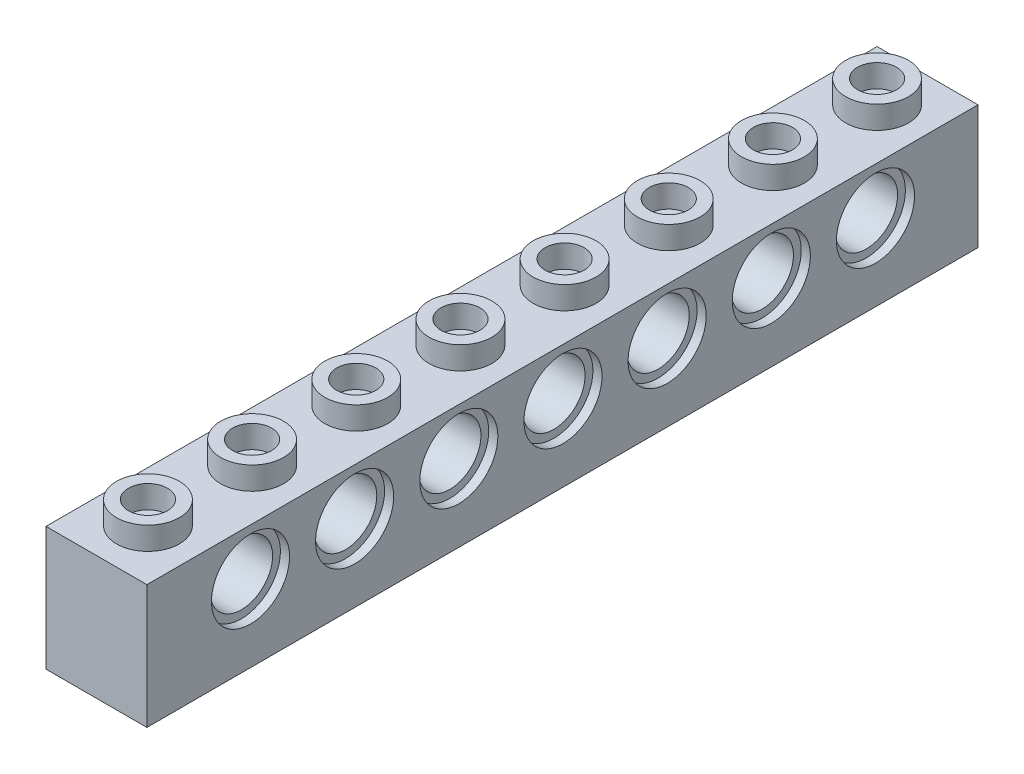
from build123d import *

# Parameters (mm, degrees)
SKETCH1_W           = 7.75
SKETCH1_H           = 9.5
BOSS_EXTRUDE1_DEPTH = 63.83
SKETCH2_R           = 2.415
SKETCH2_R_2         = 1.5
BOSS_EXTRUDE2_DEPTH = 1.75
LPATTERN1_COUNT     = 8
LPATTERN1_PITCH     = 8
SKETCH4_W           = 4.85
SKETCH4_H           = 60.93
CUT_EXTRUDE1_DEPTH  = 1.75
SKETCH5_R           = 1.5
BOSS_EXTRUDE3_DEPTH = 1.75
LPATTERN2_COUNT     = 7
LPATTERN2_PITCH     = 8
SKETCH6_R           = 3
CUT_EXTRUDE2_DEPTH  = 0.7
CUT_EXTRUDE3_START  = -0.7
SKETCH7_R           = 3
CUT_EXTRUDE3_DEPTH  = 0.7
SKETCH8_R           = 2.4
CUT_EXTRUDE4_DEPTH  = 65.626475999
LPATTERN3_COUNT     = 7
LPATTERN3_PITCH     = 8


with BuildPart() as part:
    # Sketch1 → Boss-Extrude1 (new body)
    with BuildSketch(Plane.XY):
        Rectangle(SKETCH1_W, SKETCH1_H)
    extrude(amount=BOSS_EXTRUDE1_DEPTH)

    # Sketch2 → Boss-Extrude2 (add)
    with BuildSketch(Plane(origin=(0, 4.75, 0), x_dir=(1, 0, 0), z_dir=(0, 1, 0))):
        with Locations((0, -3.875)):
            Circle(SKETCH2_R)
        with Locations(Location((0, -3.875, 0), (0, 0, 180))):
            Circle(SKETCH2_R_2, mode=Mode.SUBTRACT)
    boss_extrude2 = extrude(amount=BOSS_EXTRUDE2_DEPTH)

    # LPattern1: Boss-Extrude2 ×8
    with Locations(*[(0, 0, i * LPATTERN1_PITCH) for i in range(1, LPATTERN1_COUNT)]):
        add(boss_extrude2)

    # Sketch4 → Cut-Extrude1 (cut)
    with BuildSketch(Plane.XZ.offset(4.75)):
        with Locations((0, 31.915)):
            Rectangle(SKETCH4_W, SKETCH4_H)
    extrude(amount=-CUT_EXTRUDE1_DEPTH, mode=Mode.SUBTRACT)

    # Sketch5 → Boss-Extrude3 (add)
    with BuildSketch(Plane.XZ.offset(3)):
        with Locations(Location((0, 56.23, 0), (0, 0, 270))):
            Circle(SKETCH5_R)
    boss_extrude3 = extrude(amount=BOSS_EXTRUDE3_DEPTH)

    # LPattern2: Boss-Extrude3 ×7
    with Locations(*[(0, 0, -i * LPATTERN2_PITCH) for i in range(1, LPATTERN2_COUNT)]):
        add(boss_extrude3)

    # Sketch6 → Cut-Extrude2 (cut)
    with BuildSketch(Plane(origin=(3.875, 0, 0), x_dir=(0, 0, -1), z_dir=(1, 0, 0))):
        with Locations((-7.875, 1.15)):
            Circle(SKETCH6_R)
    cut_extrude2 = extrude(amount=-CUT_EXTRUDE2_DEPTH, mode=Mode.SUBTRACT)

    # Sketch7 → Cut-Extrude3 (cut)
    with BuildSketch(Plane.ZY.offset(3.875).offset(CUT_EXTRUDE3_START)):
        with Locations(Location((7.875, 1.15, 0), (0, 0, 180))):
            Circle(SKETCH7_R)
    cut_extrude3 = extrude(amount=CUT_EXTRUDE3_DEPTH, mode=Mode.SUBTRACT)

    # Sketch8 → Cut-Extrude4 (cut, through all)
    with BuildSketch(Plane.ZY.offset(3.875)):
        with Locations((7.875, 1.15)):
            Circle(SKETCH8_R)
    cut_extrude4 = extrude(amount=-CUT_EXTRUDE4_DEPTH, mode=Mode.SUBTRACT)

    # LPattern3: Cut-Extrude2, Cut-Extrude3, Cut-Extrude4 ×7
    with Locations(*[(0, 0, i * LPATTERN3_PITCH) for i in range(1, LPATTERN3_COUNT)]):
        add(cut_extrude2, mode=Mode.SUBTRACT)
        add(cut_extrude3, mode=Mode.SUBTRACT)
        add(cut_extrude4, mode=Mode.SUBTRACT)


solid = part.part
